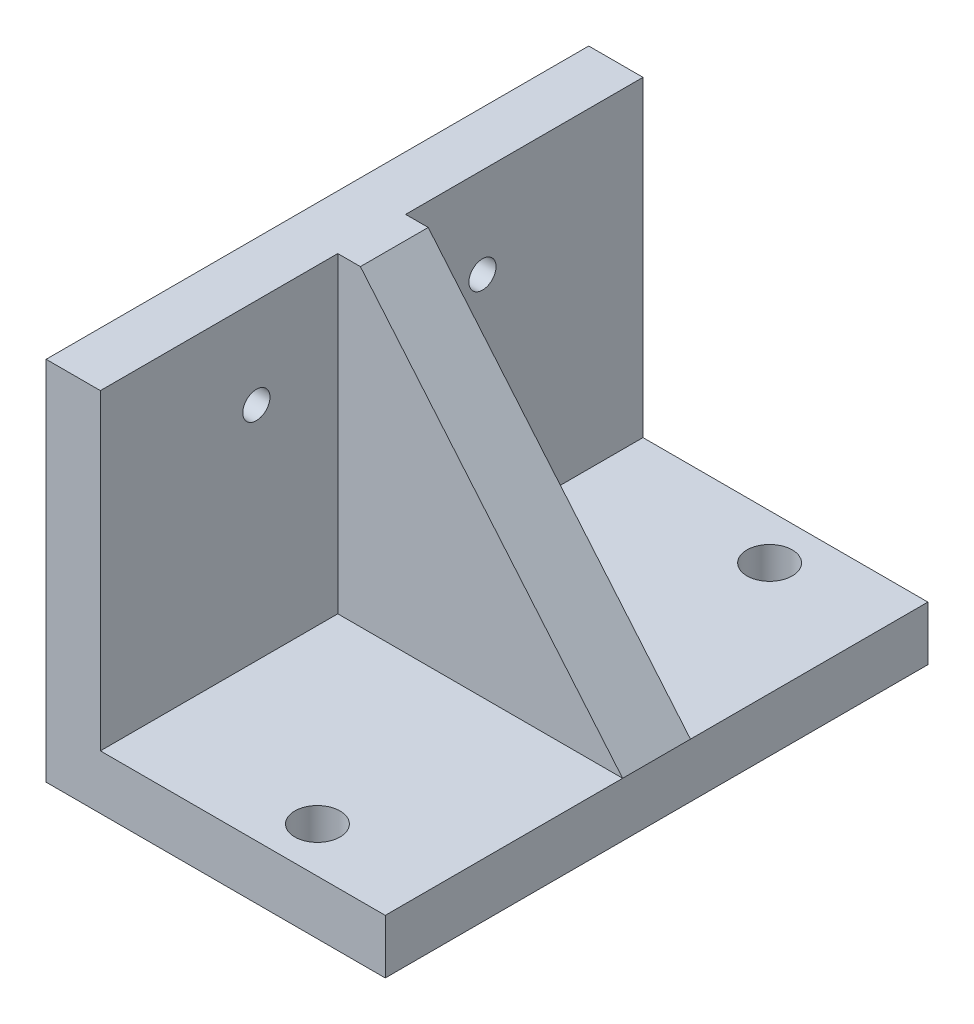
ISO-10303-21;
HEADER;
FILE_DESCRIPTION(('STEP AP214'),'2;1');
FILE_NAME('part.step','',(''),(''),'','','');
FILE_SCHEMA(('AUTOMOTIVE_DESIGN { 1 0 10303 214 1 1 1 1 }'));
ENDSEC;
DATA;
#1=APPLICATION_CONTEXT('core data for automotive mechanical design processes');
#2=APPLICATION_PROTOCOL_DEFINITION('international standard','automotive_design',2000,#1);
#3=PRODUCT_CONTEXT('',#1,'mechanical');
#4=PRODUCT('Part','Part','',(#3));
#5=PRODUCT_RELATED_PRODUCT_CATEGORY('part','',(#4));
#6=PRODUCT_DEFINITION_FORMATION('','',#4);
#7=PRODUCT_DEFINITION_CONTEXT('part definition',#1,'design');
#8=PRODUCT_DEFINITION('design','',#6,#7);
#9=PRODUCT_DEFINITION_SHAPE('','',#8);
#10=(LENGTH_UNIT() NAMED_UNIT(*) SI_UNIT(.MILLI.,.METRE.));
#11=(NAMED_UNIT(*) PLANE_ANGLE_UNIT() SI_UNIT($,.RADIAN.));
#12=(NAMED_UNIT(*) SI_UNIT($,.STERADIAN.) SOLID_ANGLE_UNIT());
#13=UNCERTAINTY_MEASURE_WITH_UNIT(LENGTH_MEASURE(1.E-05),#10,'distance_accuracy_value','');
#14=(GEOMETRIC_REPRESENTATION_CONTEXT(3) GLOBAL_UNCERTAINTY_ASSIGNED_CONTEXT((#13)) GLOBAL_UNIT_ASSIGNED_CONTEXT((#10,
#11,#12)) REPRESENTATION_CONTEXT('',''));
#15=CARTESIAN_POINT('',(0.,0.,0.));
#16=DIRECTION('',(0.,0.,1.));
#17=DIRECTION('',(1.,0.,0.));
#18=AXIS2_PLACEMENT_3D('',#15,#16,#17);
#19=CARTESIAN_POINT('',(12.,12.,120.));
#20=DIRECTION('',(0.,-1.,0.));
#21=DIRECTION('',(0.,0.,-1.));
#22=AXIS2_PLACEMENT_3D('',#19,#20,#21);
#23=PLANE('',#22);
#24=CARTESIAN_POINT('',(50.,12.,10.));
#25=DIRECTION('',(0.,1.,0.));
#26=DIRECTION('',(0.,0.,1.));
#27=AXIS2_PLACEMENT_3D('',#24,#25,#26);
#28=CIRCLE('',#27,5.);
#29=CARTESIAN_POINT('',(50.,12.,15.));
#30=VERTEX_POINT('',#29);
#31=EDGE_CURVE('E318',#30,#30,#28,.T.);
#32=ORIENTED_EDGE('',*,*,#31,.F.);
#33=EDGE_LOOP('',(#32));
#34=FACE_BOUND('',#33,.T.);
#35=DIRECTION('',(-1.,0.,0.));
#36=VECTOR('',#35,1.);
#37=CARTESIAN_POINT('',(12.,12.,52.5));
#38=LINE('',#37,#36);
#39=CARTESIAN_POINT('',(75.,12.,52.5));
#40=VERTEX_POINT('',#39);
#41=CARTESIAN_POINT('',(12.,12.,52.5));
#42=VERTEX_POINT('',#41);
#43=EDGE_CURVE('E124',#40,#42,#38,.T.);
#44=ORIENTED_EDGE('',*,*,#43,.F.);
#45=DIRECTION('',(0.,0.,-1.));
#46=VECTOR('',#45,1.);
#47=CARTESIAN_POINT('',(75.,12.,120.));
#48=LINE('',#47,#46);
#49=CARTESIAN_POINT('',(75.,12.,0.));
#50=VERTEX_POINT('',#49);
#51=EDGE_CURVE('E170',#40,#50,#48,.T.);
#52=ORIENTED_EDGE('',*,*,#51,.T.);
#53=DIRECTION('',(-1.,0.,0.));
#54=VECTOR('',#53,1.);
#55=CARTESIAN_POINT('',(12.,12.,0.));
#56=LINE('',#55,#54);
#57=CARTESIAN_POINT('',(12.,12.,0.));
#58=VERTEX_POINT('',#57);
#59=EDGE_CURVE('E141',#50,#58,#56,.T.);
#60=ORIENTED_EDGE('',*,*,#59,.T.);
#61=DIRECTION('',(0.,0.,-1.));
#62=VECTOR('',#61,1.);
#63=CARTESIAN_POINT('',(12.,12.,120.));
#64=LINE('',#63,#62);
#65=EDGE_CURVE('E166',#42,#58,#64,.T.);
#66=ORIENTED_EDGE('',*,*,#65,.F.);
#67=EDGE_LOOP('',(#44,#52,#60,#66));
#68=FACE_BOUND('',#67,.T.);
#69=ADVANCED_FACE('F17',(#34,#68),#23,.F.);
#70=CARTESIAN_POINT('',(12.,12.,120.));
#71=DIRECTION('',(-1.,0.,0.));
#72=DIRECTION('',(0.,-1.,0.));
#73=AXIS2_PLACEMENT_3D('',#70,#71,#72);
#74=PLANE('',#73);
#75=CARTESIAN_POINT('',(12.,61.,35.5));
#76=DIRECTION('',(1.,0.,0.));
#77=DIRECTION('',(0.,1.,0.));
#78=AXIS2_PLACEMENT_3D('',#75,#76,#77);
#79=CIRCLE('',#78,3.);
#80=CARTESIAN_POINT('',(12.,64.,35.5));
#81=VERTEX_POINT('',#80);
#82=EDGE_CURVE('E330',#81,#81,#79,.T.);
#83=ORIENTED_EDGE('',*,*,#82,.F.);
#84=EDGE_LOOP('',(#83));
#85=FACE_BOUND('',#84,.T.);
#86=DIRECTION('',(0.,1.,0.));
#87=VECTOR('',#86,1.);
#88=CARTESIAN_POINT('',(12.,12.,52.5));
#89=LINE('',#88,#87);
#90=CARTESIAN_POINT('',(12.,81.,52.5));
#91=VERTEX_POINT('',#90);
#92=EDGE_CURVE('E108',#42,#91,#89,.T.);
#93=ORIENTED_EDGE('',*,*,#92,.F.);
#94=ORIENTED_EDGE('',*,*,#65,.T.);
#95=DIRECTION('',(0.,1.,0.));
#96=VECTOR('',#95,1.);
#97=CARTESIAN_POINT('',(12.,12.,0.));
#98=LINE('',#97,#96);
#99=CARTESIAN_POINT('',(12.,81.,0.));
#100=VERTEX_POINT('',#99);
#101=EDGE_CURVE('E144',#58,#100,#98,.T.);
#102=ORIENTED_EDGE('',*,*,#101,.T.);
#103=DIRECTION('',(0.,0.,-1.));
#104=VECTOR('',#103,1.);
#105=CARTESIAN_POINT('',(12.,81.,120.));
#106=LINE('',#105,#104);
#107=EDGE_CURVE('E163',#91,#100,#106,.T.);
#108=ORIENTED_EDGE('',*,*,#107,.F.);
#109=EDGE_LOOP('',(#93,#94,#102,#108));
#110=FACE_BOUND('',#109,.T.);
#111=ADVANCED_FACE('F202',(#85,#110),#74,.F.);
#112=CARTESIAN_POINT('',(0.,0.,120.));
#113=DIRECTION('',(1.,0.,0.));
#114=DIRECTION('',(0.,1.,0.));
#115=AXIS2_PLACEMENT_3D('',#112,#113,#114);
#116=PLANE('',#115);
#117=DIRECTION('',(0.,0.,-1.));
#118=VECTOR('',#117,1.);
#119=CARTESIAN_POINT('',(0.,81.,120.));
#120=LINE('',#119,#118);
#121=CARTESIAN_POINT('',(0.,81.,120.));
#122=VERTEX_POINT('',#121);
#123=CARTESIAN_POINT('',(0.,81.,0.));
#124=VERTEX_POINT('',#123);
#125=EDGE_CURVE('E161',#122,#124,#120,.T.);
#126=ORIENTED_EDGE('',*,*,#125,.T.);
#127=DIRECTION('',(0.,-1.,0.));
#128=VECTOR('',#127,1.);
#129=CARTESIAN_POINT('',(0.,0.,0.));
#130=LINE('',#129,#128);
#131=CARTESIAN_POINT('',(0.,0.,0.));
#132=VERTEX_POINT('',#131);
#133=EDGE_CURVE('E132',#124,#132,#130,.T.);
#134=ORIENTED_EDGE('',*,*,#133,.T.);
#135=DIRECTION('',(0.,0.,-1.));
#136=VECTOR('',#135,1.);
#137=CARTESIAN_POINT('',(0.,0.,120.));
#138=LINE('',#137,#136);
#139=CARTESIAN_POINT('',(0.,0.,120.));
#140=VERTEX_POINT('',#139);
#141=EDGE_CURVE('E11',#140,#132,#138,.T.);
#142=ORIENTED_EDGE('',*,*,#141,.F.);
#143=DIRECTION('',(0.,-1.,0.));
#144=VECTOR('',#143,1.);
#145=CARTESIAN_POINT('',(0.,0.,120.));
#146=LINE('',#145,#144);
#147=EDGE_CURVE('E150',#122,#140,#146,.T.);
#148=ORIENTED_EDGE('',*,*,#147,.F.);
#149=EDGE_LOOP('',(#126,#134,#142,#148));
#150=FACE_BOUND('',#149,.T.);
#151=ADVANCED_FACE('F19',(#150),#116,.F.);
#152=CARTESIAN_POINT('',(12.,0.,120.));
#153=DIRECTION('',(0.,1.,0.));
#154=DIRECTION('',(0.,0.,1.));
#155=AXIS2_PLACEMENT_3D('',#152,#153,#154);
#156=PLANE('',#155);
#157=CARTESIAN_POINT('',(50.,0.,10.));
#158=DIRECTION('',(0.,1.,0.));
#159=DIRECTION('',(0.,0.,1.));
#160=AXIS2_PLACEMENT_3D('',#157,#158,#159);
#161=CIRCLE('',#160,5.);
#162=CARTESIAN_POINT('',(50.,0.,15.));
#163=VERTEX_POINT('',#162);
#164=EDGE_CURVE('E316',#163,#163,#161,.T.);
#165=ORIENTED_EDGE('',*,*,#164,.T.);
#166=EDGE_LOOP('',(#165));
#167=FACE_BOUND('',#166,.T.);
#168=CARTESIAN_POINT('',(50.,0.,110.));
#169=DIRECTION('',(0.,1.,0.));
#170=DIRECTION('',(0.,0.,1.));
#171=AXIS2_PLACEMENT_3D('',#168,#169,#170);
#172=CIRCLE('',#171,5.);
#173=CARTESIAN_POINT('',(50.,0.,115.));
#174=VERTEX_POINT('',#173);
#175=EDGE_CURVE('E114',#174,#174,#172,.T.);
#176=ORIENTED_EDGE('',*,*,#175,.T.);
#177=EDGE_LOOP('',(#176));
#178=FACE_BOUND('',#177,.T.);
#179=ORIENTED_EDGE('',*,*,#141,.T.);
#180=DIRECTION('',(1.,0.,0.));
#181=VECTOR('',#180,1.);
#182=CARTESIAN_POINT('',(12.,0.,0.));
#183=LINE('',#182,#181);
#184=CARTESIAN_POINT('',(75.,0.,0.));
#185=VERTEX_POINT('',#184);
#186=EDGE_CURVE('E135',#132,#185,#183,.T.);
#187=ORIENTED_EDGE('',*,*,#186,.T.);
#188=DIRECTION('',(0.,0.,-1.));
#189=VECTOR('',#188,1.);
#190=CARTESIAN_POINT('',(75.,0.,120.));
#191=LINE('',#190,#189);
#192=CARTESIAN_POINT('',(75.,0.,120.));
#193=VERTEX_POINT('',#192);
#194=EDGE_CURVE('E25',#193,#185,#191,.T.);
#195=ORIENTED_EDGE('',*,*,#194,.F.);
#196=DIRECTION('',(1.,0.,0.));
#197=VECTOR('',#196,1.);
#198=CARTESIAN_POINT('',(0.,0.,120.));
#199=LINE('',#198,#197);
#200=EDGE_CURVE('E152',#140,#193,#199,.T.);
#201=ORIENTED_EDGE('',*,*,#200,.F.);
#202=EDGE_LOOP('',(#179,#187,#195,#201));
#203=FACE_BOUND('',#202,.T.);
#204=ADVANCED_FACE('F183',(#167,#178,#203),#156,.F.);
#205=CARTESIAN_POINT('',(75.,0.,120.));
#206=DIRECTION('',(-1.,0.,0.));
#207=DIRECTION('',(0.,0.,1.));
#208=AXIS2_PLACEMENT_3D('',#205,#206,#207);
#209=PLANE('',#208);
#210=ORIENTED_EDGE('',*,*,#194,.T.);
#211=DIRECTION('',(0.,1.,0.));
#212=VECTOR('',#211,1.);
#213=CARTESIAN_POINT('',(75.,0.,0.));
#214=LINE('',#213,#212);
#215=EDGE_CURVE('E138',#185,#50,#214,.T.);
#216=ORIENTED_EDGE('',*,*,#215,.T.);
#217=ORIENTED_EDGE('',*,*,#51,.F.);
#218=CARTESIAN_POINT('',(75.,12.,67.5));
#219=VERTEX_POINT('',#218);
#220=EDGE_CURVE('E101',#219,#40,#48,.T.);
#221=ORIENTED_EDGE('',*,*,#220,.F.);
#222=CARTESIAN_POINT('',(75.,12.,120.));
#223=VERTEX_POINT('',#222);
#224=EDGE_CURVE('E171',#223,#219,#48,.T.);
#225=ORIENTED_EDGE('',*,*,#224,.F.);
#226=DIRECTION('',(0.,1.,0.));
#227=VECTOR('',#226,1.);
#228=CARTESIAN_POINT('',(75.,0.,120.));
#229=LINE('',#228,#227);
#230=EDGE_CURVE('E154',#193,#223,#229,.T.);
#231=ORIENTED_EDGE('',*,*,#230,.F.);
#232=EDGE_LOOP('',(#210,#216,#217,#221,#225,#231));
#233=FACE_BOUND('',#232,.T.);
#234=ADVANCED_FACE('F176',(#233),#209,.F.);
#235=CARTESIAN_POINT('',(50.,12.,110.));
#236=DIRECTION('',(0.,1.,0.));
#237=DIRECTION('',(0.,0.,1.));
#238=AXIS2_PLACEMENT_3D('',#235,#236,#237);
#239=CIRCLE('',#238,5.);
#240=CARTESIAN_POINT('',(50.,12.,115.));
#241=VERTEX_POINT('',#240);
#242=EDGE_CURVE('E117',#241,#241,#239,.T.);
#243=ORIENTED_EDGE('',*,*,#242,.F.);
#244=EDGE_LOOP('',(#243));
#245=FACE_BOUND('',#244,.T.);
#246=ORIENTED_EDGE('',*,*,#224,.T.);
#247=DIRECTION('',(-1.,0.,0.));
#248=VECTOR('',#247,1.);
#249=CARTESIAN_POINT('',(12.,12.,67.5));
#250=LINE('',#249,#248);
#251=CARTESIAN_POINT('',(12.,12.,67.5));
#252=VERTEX_POINT('',#251);
#253=EDGE_CURVE('E129',#219,#252,#250,.T.);
#254=ORIENTED_EDGE('',*,*,#253,.T.);
#255=CARTESIAN_POINT('',(12.,12.,120.));
#256=VERTEX_POINT('',#255);
#257=EDGE_CURVE('E167',#256,#252,#64,.T.);
#258=ORIENTED_EDGE('',*,*,#257,.F.);
#259=DIRECTION('',(-1.,0.,0.));
#260=VECTOR('',#259,1.);
#261=CARTESIAN_POINT('',(12.,12.,120.));
#262=LINE('',#261,#260);
#263=EDGE_CURVE('E156',#223,#256,#262,.T.);
#264=ORIENTED_EDGE('',*,*,#263,.F.);
#265=EDGE_LOOP('',(#246,#254,#258,#264));
#266=FACE_BOUND('',#265,.T.);
#267=ADVANCED_FACE('F194',(#245,#266),#23,.F.);
#268=CARTESIAN_POINT('',(12.,61.,85.5));
#269=DIRECTION('',(1.,0.,0.));
#270=DIRECTION('',(0.,1.,0.));
#271=AXIS2_PLACEMENT_3D('',#268,#269,#270);
#272=CIRCLE('',#271,3.);
#273=CARTESIAN_POINT('',(12.,64.,85.5));
#274=VERTEX_POINT('',#273);
#275=EDGE_CURVE('E226',#274,#274,#272,.T.);
#276=ORIENTED_EDGE('',*,*,#275,.F.);
#277=EDGE_LOOP('',(#276));
#278=FACE_BOUND('',#277,.T.);
#279=ORIENTED_EDGE('',*,*,#257,.T.);
#280=DIRECTION('',(0.,1.,0.));
#281=VECTOR('',#280,1.);
#282=CARTESIAN_POINT('',(12.,12.,67.5));
#283=LINE('',#282,#281);
#284=CARTESIAN_POINT('',(12.,81.,67.5));
#285=VERTEX_POINT('',#284);
#286=EDGE_CURVE('E126',#252,#285,#283,.T.);
#287=ORIENTED_EDGE('',*,*,#286,.T.);
#288=CARTESIAN_POINT('',(12.,81.,120.));
#289=VERTEX_POINT('',#288);
#290=EDGE_CURVE('E164',#289,#285,#106,.T.);
#291=ORIENTED_EDGE('',*,*,#290,.F.);
#292=DIRECTION('',(0.,1.,0.));
#293=VECTOR('',#292,1.);
#294=CARTESIAN_POINT('',(12.,12.,120.));
#295=LINE('',#294,#293);
#296=EDGE_CURVE('E158',#256,#289,#295,.T.);
#297=ORIENTED_EDGE('',*,*,#296,.F.);
#298=EDGE_LOOP('',(#279,#287,#291,#297));
#299=FACE_BOUND('',#298,.T.);
#300=ADVANCED_FACE('F206',(#278,#299),#74,.F.);
#301=CARTESIAN_POINT('',(0.,81.,120.));
#302=DIRECTION('',(0.,-1.,0.));
#303=DIRECTION('',(0.,0.,-1.));
#304=AXIS2_PLACEMENT_3D('',#301,#302,#303);
#305=PLANE('',#304);
#306=ORIENTED_EDGE('',*,*,#290,.T.);
#307=DIRECTION('',(1.,0.,0.));
#308=VECTOR('',#307,1.);
#309=CARTESIAN_POINT('',(37.5,81.,67.5));
#310=LINE('',#309,#308);
#311=CARTESIAN_POINT('',(17.,81.,67.5));
#312=VERTEX_POINT('',#311);
#313=EDGE_CURVE('E104',#312,#285,#310,.F.);
#314=ORIENTED_EDGE('',*,*,#313,.F.);
#315=DIRECTION('',(0.,0.,1.));
#316=VECTOR('',#315,1.);
#317=CARTESIAN_POINT('',(17.,81.,60.));
#318=LINE('',#317,#316);
#319=CARTESIAN_POINT('',(17.,81.,52.5));
#320=VERTEX_POINT('',#319);
#321=EDGE_CURVE('E98',#320,#312,#318,.T.);
#322=ORIENTED_EDGE('',*,*,#321,.F.);
#323=DIRECTION('',(1.,0.,0.));
#324=VECTOR('',#323,1.);
#325=CARTESIAN_POINT('',(37.5,81.,52.5));
#326=LINE('',#325,#324);
#327=EDGE_CURVE('E32',#320,#91,#326,.F.);
#328=ORIENTED_EDGE('',*,*,#327,.T.);
#329=ORIENTED_EDGE('',*,*,#107,.T.);
#330=DIRECTION('',(-1.,0.,0.));
#331=VECTOR('',#330,1.);
#332=CARTESIAN_POINT('',(0.,81.,0.));
#333=LINE('',#332,#331);
#334=EDGE_CURVE('E147',#100,#124,#333,.T.);
#335=ORIENTED_EDGE('',*,*,#334,.T.);
#336=ORIENTED_EDGE('',*,*,#125,.F.);
#337=DIRECTION('',(-1.,0.,0.));
#338=VECTOR('',#337,1.);
#339=CARTESIAN_POINT('',(0.,81.,120.));
#340=LINE('',#339,#338);
#341=EDGE_CURVE('E40',#289,#122,#340,.T.);
#342=ORIENTED_EDGE('',*,*,#341,.F.);
#343=EDGE_LOOP('',(#306,#314,#322,#328,#329,#335,#336,#342));
#344=FACE_BOUND('',#343,.T.);
#345=ADVANCED_FACE('F107',(#344),#305,.F.);
#346=CARTESIAN_POINT('',(0.,81.,120.));
#347=DIRECTION('',(0.,0.,-1.));
#348=DIRECTION('',(-1.,0.,0.));
#349=AXIS2_PLACEMENT_3D('',#346,#347,#348);
#350=PLANE('',#349);
#351=ORIENTED_EDGE('',*,*,#147,.T.);
#352=ORIENTED_EDGE('',*,*,#200,.T.);
#353=ORIENTED_EDGE('',*,*,#230,.T.);
#354=ORIENTED_EDGE('',*,*,#263,.T.);
#355=ORIENTED_EDGE('',*,*,#296,.T.);
#356=ORIENTED_EDGE('',*,*,#341,.T.);
#357=EDGE_LOOP('',(#351,#352,#353,#354,#355,#356));
#358=FACE_BOUND('',#357,.T.);
#359=ADVANCED_FACE('F197',(#358),#350,.F.);
#360=CARTESIAN_POINT('',(0.,81.,0.));
#361=DIRECTION('',(0.,0.,-1.));
#362=DIRECTION('',(-1.,0.,0.));
#363=AXIS2_PLACEMENT_3D('',#360,#361,#362);
#364=PLANE('',#363);
#365=ORIENTED_EDGE('',*,*,#133,.F.);
#366=ORIENTED_EDGE('',*,*,#334,.F.);
#367=ORIENTED_EDGE('',*,*,#101,.F.);
#368=ORIENTED_EDGE('',*,*,#59,.F.);
#369=ORIENTED_EDGE('',*,*,#215,.F.);
#370=ORIENTED_EDGE('',*,*,#186,.F.);
#371=EDGE_LOOP('',(#365,#366,#367,#368,#369,#370));
#372=FACE_BOUND('',#371,.T.);
#373=ADVANCED_FACE('F187',(#372),#364,.T.);
#374=CARTESIAN_POINT('',(75.,12.,60.));
#375=DIRECTION('',(0.765486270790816,0.643452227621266,0.));
#376=DIRECTION('',(-0.643452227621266,0.765486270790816,0.));
#377=AXIS2_PLACEMENT_3D('',#374,#375,#376);
#378=PLANE('',#377);
#379=ORIENTED_EDGE('',*,*,#220,.T.);
#380=DIRECTION('',(-0.643452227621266,0.765486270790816,0.));
#381=VECTOR('',#380,1.);
#382=CARTESIAN_POINT('',(75.,12.,52.5));
#383=LINE('',#382,#381);
#384=EDGE_CURVE('E95',#40,#320,#383,.T.);
#385=ORIENTED_EDGE('',*,*,#384,.T.);
#386=ORIENTED_EDGE('',*,*,#321,.T.);
#387=DIRECTION('',(-0.643452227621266,0.765486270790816,0.));
#388=VECTOR('',#387,1.);
#389=CARTESIAN_POINT('',(75.,12.,67.5));
#390=LINE('',#389,#388);
#391=EDGE_CURVE('E109',#219,#312,#390,.T.);
#392=ORIENTED_EDGE('',*,*,#391,.F.);
#393=EDGE_LOOP('',(#379,#385,#386,#392));
#394=FACE_BOUND('',#393,.T.);
#395=ADVANCED_FACE('F96',(#394),#378,.T.);
#396=CARTESIAN_POINT('',(37.5,40.5,67.5));
#397=DIRECTION('',(0.,0.,1.));
#398=DIRECTION('',(1.,0.,0.));
#399=AXIS2_PLACEMENT_3D('',#396,#397,#398);
#400=PLANE('',#399);
#401=ORIENTED_EDGE('',*,*,#253,.F.);
#402=ORIENTED_EDGE('',*,*,#391,.T.);
#403=ORIENTED_EDGE('',*,*,#313,.T.);
#404=ORIENTED_EDGE('',*,*,#286,.F.);
#405=EDGE_LOOP('',(#401,#402,#403,#404));
#406=FACE_BOUND('',#405,.T.);
#407=ADVANCED_FACE('F228',(#406),#400,.T.);
#408=CARTESIAN_POINT('',(37.5,40.5,52.5));
#409=DIRECTION('',(0.,0.,1.));
#410=DIRECTION('',(1.,0.,0.));
#411=AXIS2_PLACEMENT_3D('',#408,#409,#410);
#412=PLANE('',#411);
#413=ORIENTED_EDGE('',*,*,#384,.F.);
#414=ORIENTED_EDGE('',*,*,#43,.T.);
#415=ORIENTED_EDGE('',*,*,#92,.T.);
#416=ORIENTED_EDGE('',*,*,#327,.F.);
#417=EDGE_LOOP('',(#413,#414,#415,#416));
#418=FACE_BOUND('',#417,.T.);
#419=ADVANCED_FACE('F111',(#418),#412,.F.);
#420=CARTESIAN_POINT('',(50.,0.,110.));
#421=DIRECTION('',(0.,1.,0.));
#422=DIRECTION('',(0.,0.,1.));
#423=AXIS2_PLACEMENT_3D('',#420,#421,#422);
#424=CYLINDRICAL_SURFACE('',#423,5.);
#425=ORIENTED_EDGE('',*,*,#175,.F.);
#426=EDGE_LOOP('',(#425));
#427=FACE_BOUND('',#426,.T.);
#428=ORIENTED_EDGE('',*,*,#242,.T.);
#429=EDGE_LOOP('',(#428));
#430=FACE_BOUND('',#429,.T.);
#431=ADVANCED_FACE('F234',(#427,#430),#424,.F.);
#432=CARTESIAN_POINT('',(50.,0.,10.));
#433=DIRECTION('',(0.,1.,0.));
#434=DIRECTION('',(0.,0.,1.));
#435=AXIS2_PLACEMENT_3D('',#432,#433,#434);
#436=CYLINDRICAL_SURFACE('',#435,5.);
#437=ORIENTED_EDGE('',*,*,#164,.F.);
#438=EDGE_LOOP('',(#437));
#439=FACE_BOUND('',#438,.T.);
#440=ORIENTED_EDGE('',*,*,#31,.T.);
#441=EDGE_LOOP('',(#440));
#442=FACE_BOUND('',#441,.T.);
#443=ADVANCED_FACE('F293',(#439,#442),#436,.F.);
#444=CARTESIAN_POINT('',(2.,61.,85.5));
#445=DIRECTION('',(1.,0.,0.));
#446=DIRECTION('',(0.,1.,0.));
#447=AXIS2_PLACEMENT_3D('',#444,#445,#446);
#448=CYLINDRICAL_SURFACE('',#447,3.);
#449=CARTESIAN_POINT('',(2.,61.,85.5));
#450=DIRECTION('',(1.,0.,0.));
#451=DIRECTION('',(0.,1.,0.));
#452=AXIS2_PLACEMENT_3D('',#449,#450,#451);
#453=CIRCLE('',#452,3.);
#454=CARTESIAN_POINT('',(2.,64.,85.5));
#455=VERTEX_POINT('',#454);
#456=EDGE_CURVE('E323',#455,#455,#453,.T.);
#457=ORIENTED_EDGE('',*,*,#456,.F.);
#458=EDGE_LOOP('',(#457));
#459=FACE_BOUND('',#458,.T.);
#460=ORIENTED_EDGE('',*,*,#275,.T.);
#461=EDGE_LOOP('',(#460));
#462=FACE_BOUND('',#461,.T.);
#463=ADVANCED_FACE('F285',(#459,#462),#448,.F.);
#464=CARTESIAN_POINT('',(2.,61.,85.5));
#465=DIRECTION('',(1.,0.,0.));
#466=DIRECTION('',(0.,1.,0.));
#467=AXIS2_PLACEMENT_3D('',#464,#465,#466);
#468=PLANE('',#467);
#469=ORIENTED_EDGE('',*,*,#456,.T.);
#470=EDGE_LOOP('',(#469));
#471=FACE_BOUND('',#470,.T.);
#472=ADVANCED_FACE('F277',(#471),#468,.T.);
#473=CARTESIAN_POINT('',(2.,61.,35.5));
#474=DIRECTION('',(1.,0.,0.));
#475=DIRECTION('',(0.,1.,0.));
#476=AXIS2_PLACEMENT_3D('',#473,#474,#475);
#477=CYLINDRICAL_SURFACE('',#476,3.);
#478=CARTESIAN_POINT('',(2.,61.,35.5));
#479=DIRECTION('',(1.,0.,0.));
#480=DIRECTION('',(0.,1.,0.));
#481=AXIS2_PLACEMENT_3D('',#478,#479,#480);
#482=CIRCLE('',#481,3.);
#483=CARTESIAN_POINT('',(2.,64.,35.5));
#484=VERTEX_POINT('',#483);
#485=EDGE_CURVE('E327',#484,#484,#482,.T.);
#486=ORIENTED_EDGE('',*,*,#485,.F.);
#487=EDGE_LOOP('',(#486));
#488=FACE_BOUND('',#487,.T.);
#489=ORIENTED_EDGE('',*,*,#82,.T.);
#490=EDGE_LOOP('',(#489));
#491=FACE_BOUND('',#490,.T.);
#492=ADVANCED_FACE('F269',(#488,#491),#477,.F.);
#493=CARTESIAN_POINT('',(2.,61.,35.5));
#494=DIRECTION('',(1.,0.,0.));
#495=DIRECTION('',(0.,1.,0.));
#496=AXIS2_PLACEMENT_3D('',#493,#494,#495);
#497=PLANE('',#496);
#498=ORIENTED_EDGE('',*,*,#485,.T.);
#499=EDGE_LOOP('',(#498));
#500=FACE_BOUND('',#499,.T.);
#501=ADVANCED_FACE('F266',(#500),#497,.T.);
#502=CLOSED_SHELL('',(#69,#111,#151,#204,#234,#267,#300,#345,#359,#373,#395,#407,#419,#431,#443,
#463,#472,#492,#501));
#503=MANIFOLD_SOLID_BREP('B1',#502);
#504=ADVANCED_BREP_SHAPE_REPRESENTATION('',(#18,#503),#14);
#505=SHAPE_DEFINITION_REPRESENTATION(#9,#504);
ENDSEC;
END-ISO-10303-21;
